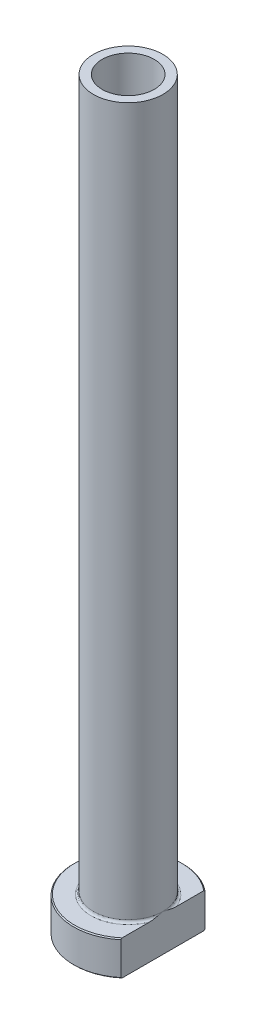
from build123d import *

# Parameters (mm, degrees)
FILLET1_R          = 0.5
CHAMFER1_SIZE      = 0.2
CUT_EXTRUDE1_DEPTH = 151.804509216
CHAMFER2_SIZE      = 0.5


with BuildPart() as part:
    # Sketch1 → Revolve1 (revolve)
    with BuildSketch(Plane.XY, mode=Mode.PRIVATE) as revolve1_sk:
        Polygon((-5.25, 150), (-7, 150), (-7, 7), (-11, 7), (-11, 0), (-5.5, 0), (-5.5, 83), (-5.25, 95), align=None)
    revolve(revolve1_sk.sketch.rotate(Axis((0, 92.187680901, 0), (0, -1, 0)), 270), axis=Axis((0, 92.187680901, 0), (0, -1, 0)))

    # Fillet1
    fillet1_edges = [part.edges().sort_by_distance(p)[0] for p in [
        (0, 7, -7),
    ]]
    fillet(fillet1_edges, radius=FILLET1_R)

    # Chamfer1
    chamfer1_edges = [part.edges().sort_by_distance(p)[0] for p in [
        (0, 0, -11),
        (0, 7, -11),
    ]]
    chamfer(chamfer1_edges, length=CHAMFER1_SIZE)

    # Sketch2 → Cut-Extrude1 (cut, through all)
    with BuildSketch(Plane.XZ):
        with BuildLine():
            Line((7, 8.485281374), (7, -8.485281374))
            ThreePointArc((7, -8.485281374), (11, 0), (7, 8.485281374))
        make_face()
    extrude(amount=-CUT_EXTRUDE1_DEPTH, mode=Mode.SUBTRACT)

    # Chamfer2
    chamfer2_edges = [part.edges().sort_by_distance(p)[0] for p in [
        (0, 0, -5.5),
    ]]
    chamfer(chamfer2_edges, length=CHAMFER2_SIZE)


solid = part.part
